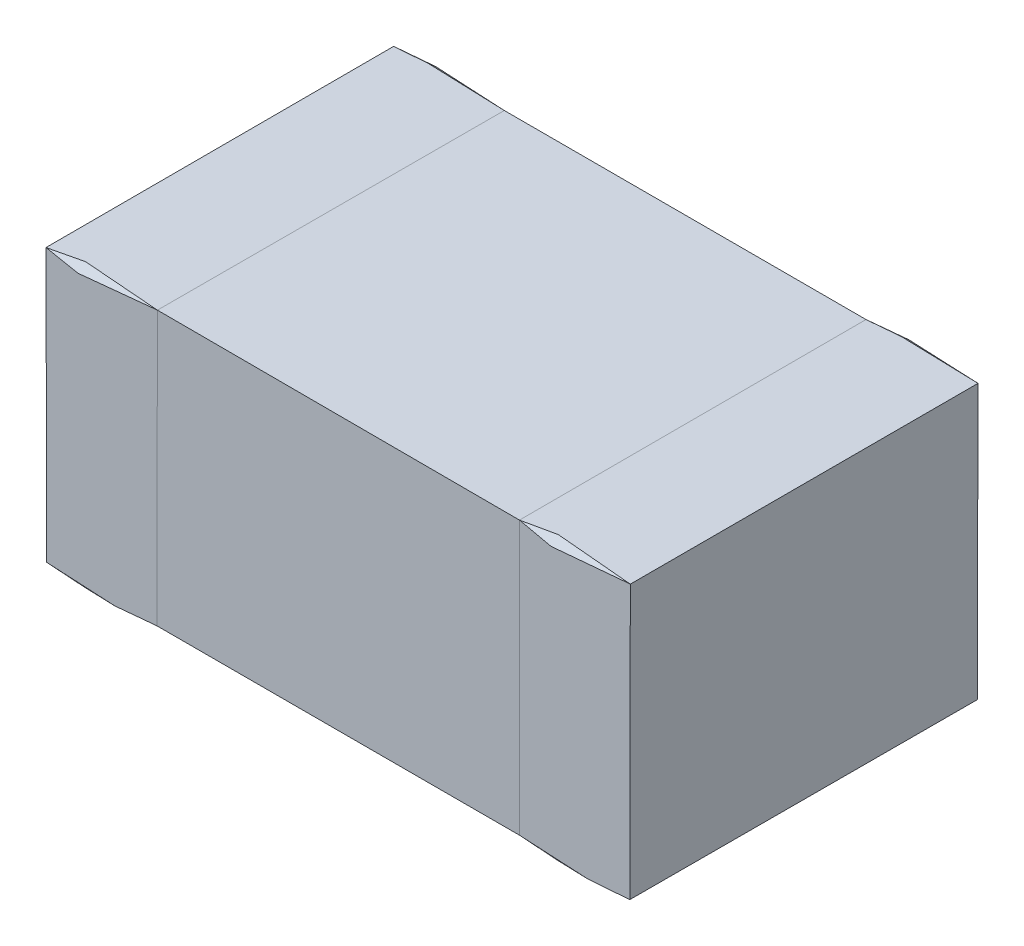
ISO-10303-21;
HEADER;
FILE_DESCRIPTION(('STEP AP214'),'2;1');
FILE_NAME('part.step','',(''),(''),'','','');
FILE_SCHEMA(('AUTOMOTIVE_DESIGN { 1 0 10303 214 1 1 1 1 }'));
ENDSEC;
DATA;
#1=APPLICATION_CONTEXT('core data for automotive mechanical design processes');
#2=APPLICATION_PROTOCOL_DEFINITION('international standard','automotive_design',2000,#1);
#3=PRODUCT_CONTEXT('',#1,'mechanical');
#4=PRODUCT('Part','Part','',(#3));
#5=PRODUCT_RELATED_PRODUCT_CATEGORY('part','',(#4));
#6=PRODUCT_DEFINITION_FORMATION('','',#4);
#7=PRODUCT_DEFINITION_CONTEXT('part definition',#1,'design');
#8=PRODUCT_DEFINITION('design','',#6,#7);
#9=PRODUCT_DEFINITION_SHAPE('','',#8);
#10=(LENGTH_UNIT() NAMED_UNIT(*) SI_UNIT(.MILLI.,.METRE.));
#11=(NAMED_UNIT(*) PLANE_ANGLE_UNIT() SI_UNIT($,.RADIAN.));
#12=(NAMED_UNIT(*) SI_UNIT($,.STERADIAN.) SOLID_ANGLE_UNIT());
#13=UNCERTAINTY_MEASURE_WITH_UNIT(LENGTH_MEASURE(1.E-05),#10,'distance_accuracy_value','');
#14=(GEOMETRIC_REPRESENTATION_CONTEXT(3) GLOBAL_UNCERTAINTY_ASSIGNED_CONTEXT((#13)) GLOBAL_UNIT_ASSIGNED_CONTEXT((#10,
#11,#12)) REPRESENTATION_CONTEXT('',''));
#15=CARTESIAN_POINT('',(0.,0.,0.));
#16=DIRECTION('',(0.,0.,1.));
#17=DIRECTION('',(1.,0.,0.));
#18=AXIS2_PLACEMENT_3D('',#15,#16,#17);
#19=CARTESIAN_POINT('',(0.803249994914,0.363011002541,0.986978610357));
#20=DIRECTION('',(-1.,0.,0.));
#21=DIRECTION('',(0.,0.,1.));
#22=AXIS2_PLACEMENT_3D('',#19,#20,#21);
#23=PLANE('',#22);
#24=CARTESIAN_POINT('',(0.803249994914,-0.363011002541,0.986978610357));
#25=DIRECTION('',(0.,0.,-1.));
#26=VECTOR('',#25,1.);
#27=LINE('',#24,#26);
#28=CARTESIAN_POINT('',(0.789861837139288,-0.370351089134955,0.995986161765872));
#29=VERTEX_POINT('',#28);
#30=CARTESIAN_POINT('',(0.791047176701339,-0.37070329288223,0.0560205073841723));
#31=VERTEX_POINT('',#30);
#32=EDGE_CURVE('E85',#29,#31,#27,.T.);
#33=ORIENTED_EDGE('',*,*,#32,.T.);
#34=CARTESIAN_POINT('',(0.803249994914,-0.363011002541,0.0630712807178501));
#35=DIRECTION('',(0.,1.,0.));
#36=VECTOR('',#35,1.);
#37=LINE('',#34,#36);
#38=CARTESIAN_POINT('',(0.790208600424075,0.36933356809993,0.0533398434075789));
#39=VERTEX_POINT('',#38);
#40=EDGE_CURVE('E120',#31,#39,#37,.T.);
#41=ORIENTED_EDGE('',*,*,#40,.T.);
#42=CARTESIAN_POINT('',(0.803249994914,0.363011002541,0.0630712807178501));
#43=DIRECTION('',(0.,0.,1.));
#44=VECTOR('',#43,1.);
#45=LINE('',#42,#44);
#46=CARTESIAN_POINT('',(0.790788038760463,0.369808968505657,0.995402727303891));
#47=VERTEX_POINT('',#46);
#48=EDGE_CURVE('E118',#39,#47,#45,.T.);
#49=ORIENTED_EDGE('',*,*,#48,.T.);
#50=CARTESIAN_POINT('',(0.803249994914,0.363011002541,0.986978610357));
#51=DIRECTION('',(0.,-1.,0.));
#52=VECTOR('',#51,1.);
#53=LINE('',#50,#52);
#54=EDGE_CURVE('E107',#47,#29,#53,.T.);
#55=ORIENTED_EDGE('',*,*,#54,.T.);
#56=EDGE_LOOP('',(#33,#41,#49,#55));
#57=FACE_BOUND('',#56,.T.);
#58=ADVANCED_FACE('F17',(#57),#23,.F.);
#59=CARTESIAN_POINT('',(-0.803249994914,-0.363011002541,0.986978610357));
#60=DIRECTION('',(1.,0.,0.));
#61=DIRECTION('',(0.,0.,-1.));
#62=AXIS2_PLACEMENT_3D('',#59,#60,#61);
#63=PLANE('',#62);
#64=CARTESIAN_POINT('',(-0.803249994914,0.363011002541,0.986978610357));
#65=DIRECTION('',(0.,0.,-1.));
#66=VECTOR('',#65,1.);
#67=LINE('',#64,#66);
#68=CARTESIAN_POINT('',(-0.790208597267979,0.369333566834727,0.996710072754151));
#69=VERTEX_POINT('',#68);
#70=CARTESIAN_POINT('',(-0.790788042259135,0.369808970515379,0.0546471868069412));
#71=VERTEX_POINT('',#70);
#72=EDGE_CURVE('E371',#69,#71,#67,.T.);
#73=ORIENTED_EDGE('',*,*,#72,.T.);
#74=CARTESIAN_POINT('',(-0.803249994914,0.363011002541,0.0630712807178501));
#75=DIRECTION('',(0.,-1.,0.));
#76=VECTOR('',#75,1.);
#77=LINE('',#74,#76);
#78=CARTESIAN_POINT('',(-0.790208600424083,-0.36933356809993,0.0533398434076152));
#79=VERTEX_POINT('',#78);
#80=EDGE_CURVE('E396',#71,#79,#77,.T.);
#81=ORIENTED_EDGE('',*,*,#80,.T.);
#82=CARTESIAN_POINT('',(-0.803249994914,-0.363011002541,0.0630712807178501));
#83=DIRECTION('',(0.,0.,1.));
#84=VECTOR('',#83,1.);
#85=LINE('',#82,#84);
#86=CARTESIAN_POINT('',(-0.791047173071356,-0.370703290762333,0.994029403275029));
#87=VERTEX_POINT('',#86);
#88=EDGE_CURVE('E435',#79,#87,#85,.T.);
#89=ORIENTED_EDGE('',*,*,#88,.T.);
#90=CARTESIAN_POINT('',(-0.803249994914,-0.363011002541,0.986978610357));
#91=DIRECTION('',(0.,1.,0.));
#92=VECTOR('',#91,1.);
#93=LINE('',#90,#92);
#94=EDGE_CURVE('E331',#87,#69,#93,.T.);
#95=ORIENTED_EDGE('',*,*,#94,.T.);
#96=EDGE_LOOP('',(#73,#81,#89,#95));
#97=FACE_BOUND('',#96,.T.);
#98=ADVANCED_FACE('F394',(#97),#63,.F.);
#99=CARTESIAN_POINT('',(0.784083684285,-0.382500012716,0.06056613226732));
#100=DIRECTION('',(0.,1.,0.));
#101=DIRECTION('',(0.,0.,1.));
#102=AXIS2_PLACEMENT_3D('',#99,#100,#101);
#103=PLANE('',#102);
#104=CARTESIAN_POINT('',(0.497604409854,-0.382500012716,0.989483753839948));
#105=DIRECTION('',(0.,0.,-1.));
#106=VECTOR('',#105,1.);
#107=LINE('',#104,#106);
#108=CARTESIAN_POINT('',(0.490356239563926,-0.369497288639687,0.995052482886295));
#109=VERTEX_POINT('',#108);
#110=CARTESIAN_POINT('',(0.490603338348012,-0.368634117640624,0.0536758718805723));
#111=VERTEX_POINT('',#110);
#112=EDGE_CURVE('E147',#109,#111,#107,.T.);
#113=ORIENTED_EDGE('',*,*,#112,.T.);
#114=DIRECTION('',(1.,0.,0.));
#115=VECTOR('',#114,1.);
#116=CARTESIAN_POINT('',(0.634526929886,-0.382500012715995,0.0605661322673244));
#117=LINE('',#116,#115);
#118=EDGE_CURVE('E82',#31,#111,#117,.F.);
#119=ORIENTED_EDGE('',*,*,#118,.F.);
#120=ORIENTED_EDGE('',*,*,#32,.F.);
#121=DIRECTION('',(1.,0.,0.));
#122=VECTOR('',#121,1.);
#123=CARTESIAN_POINT('',(0.634526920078,-0.382500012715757,0.98948375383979));
#124=LINE('',#123,#122);
#125=EDGE_CURVE('E89',#109,#29,#124,.T.);
#126=ORIENTED_EDGE('',*,*,#125,.F.);
#127=EDGE_LOOP('',(#113,#119,#120,#126));
#128=FACE_BOUND('',#127,.T.);
#129=ADVANCED_FACE('F88',(#128),#103,.F.);
#130=CARTESIAN_POINT('',(0.647161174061,-0.369707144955,1.004283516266));
#131=DIRECTION('',(0.,-0.756538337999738,0.653949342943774));
#132=DIRECTION('',(0.,-0.653949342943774,-0.756538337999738));
#133=AXIS2_PLACEMENT_3D('',#130,#131,#132);
#134=PLANE('',#133);
#135=DIRECTION('',(-1.,0.,0.));
#136=VECTOR('',#135,1.);
#137=CARTESIAN_POINT('',(0.497604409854,-0.365176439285,1.009524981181));
#138=LINE('',#137,#136);
#139=EDGE_CURVE('E101',#29,#109,#138,.T.);
#140=ORIENTED_EDGE('',*,*,#139,.T.);
#141=ORIENTED_EDGE('',*,*,#125,.T.);
#142=EDGE_LOOP('',(#140,#141));
#143=FACE_BOUND('',#142,.T.);
#144=ADVANCED_FACE('F100',(#143),#134,.T.);
#145=CARTESIAN_POINT('',(0.647161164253,-0.36970714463,0.04576641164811));
#146=DIRECTION('',(0.,-0.756537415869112,-0.653950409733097));
#147=DIRECTION('',(0.,0.653950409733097,-0.756537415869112));
#148=AXIS2_PLACEMENT_3D('',#145,#146,#147);
#149=PLANE('',#148);
#150=DIRECTION('',(1.,0.,0.));
#151=VECTOR('',#150,1.);
#152=CARTESIAN_POINT('',(0.497604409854,-0.365176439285,0.04052496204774));
#153=LINE('',#152,#151);
#154=EDGE_CURVE('E113',#111,#31,#153,.T.);
#155=ORIENTED_EDGE('',*,*,#154,.T.);
#156=ORIENTED_EDGE('',*,*,#118,.T.);
#157=EDGE_LOOP('',(#155,#156));
#158=FACE_BOUND('',#157,.T.);
#159=ADVANCED_FACE('F490',(#158),#149,.T.);
#160=CARTESIAN_POINT('',(0.497604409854,0.365176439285,1.009524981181));
#161=DIRECTION('',(0.,0.,-1.));
#162=DIRECTION('',(-1.,0.,0.));
#163=AXIS2_PLACEMENT_3D('',#160,#161,#162);
#164=PLANE('',#163);
#165=ORIENTED_EDGE('',*,*,#54,.F.);
#166=DIRECTION('',(1.,0.,0.));
#167=VECTOR('',#166,1.);
#168=CARTESIAN_POINT('',(0.634526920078,0.365176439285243,1.00952498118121));
#169=LINE('',#168,#167);
#170=CARTESIAN_POINT('',(0.490006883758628,0.369300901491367,0.994823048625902));
#171=VERTEX_POINT('',#170);
#172=EDGE_CURVE('E119',#47,#171,#169,.F.);
#173=ORIENTED_EDGE('',*,*,#172,.T.);
#174=CARTESIAN_POINT('',(0.497604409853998,0.365176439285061,1.009524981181));
#175=DIRECTION('',(0.,-1.,0.));
#176=VECTOR('',#175,1.);
#177=LINE('',#174,#176);
#178=EDGE_CURVE('E111',#171,#109,#177,.T.);
#179=ORIENTED_EDGE('',*,*,#178,.T.);
#180=ORIENTED_EDGE('',*,*,#139,.F.);
#181=EDGE_LOOP('',(#165,#173,#179,#180));
#182=FACE_BOUND('',#181,.T.);
#183=ADVANCED_FACE('F105',(#182),#164,.F.);
#184=CARTESIAN_POINT('',(0.497604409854,-0.365176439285,0.04052496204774));
#185=DIRECTION('',(0.,0.,1.));
#186=DIRECTION('',(1.,0.,0.));
#187=AXIS2_PLACEMENT_3D('',#184,#185,#186);
#188=PLANE('',#187);
#189=DIRECTION('',(1.,0.,0.));
#190=VECTOR('',#189,1.);
#191=CARTESIAN_POINT('',(0.634526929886,0.36517643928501,0.0405249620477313));
#192=LINE('',#191,#190);
#193=CARTESIAN_POINT('',(0.490135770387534,0.370537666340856,0.056489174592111));
#194=VERTEX_POINT('',#193);
#195=EDGE_CURVE('E262',#39,#194,#192,.F.);
#196=ORIENTED_EDGE('',*,*,#195,.F.);
#197=ORIENTED_EDGE('',*,*,#40,.F.);
#198=ORIENTED_EDGE('',*,*,#154,.F.);
#199=CARTESIAN_POINT('',(0.497604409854,-0.365176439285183,0.04052496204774));
#200=DIRECTION('',(0.,1.,0.));
#201=VECTOR('',#200,1.);
#202=LINE('',#199,#201);
#203=EDGE_CURVE('E377',#111,#194,#202,.T.);
#204=ORIENTED_EDGE('',*,*,#203,.T.);
#205=EDGE_LOOP('',(#196,#197,#198,#204));
#206=FACE_BOUND('',#205,.T.);
#207=ADVANCED_FACE('F242',(#206),#188,.F.);
#208=CARTESIAN_POINT('',(0.647161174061,0.377969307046,0.994725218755));
#209=DIRECTION('',(0.,-0.756538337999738,-0.653949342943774));
#210=DIRECTION('',(0.,0.653949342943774,-0.756538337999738));
#211=AXIS2_PLACEMENT_3D('',#208,#209,#210);
#212=PLANE('',#211);
#213=DIRECTION('',(1.,0.,0.));
#214=VECTOR('',#213,1.);
#215=CARTESIAN_POINT('',(0.497604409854,0.382500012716,0.98948375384));
#216=LINE('',#215,#214);
#217=EDGE_CURVE('E270',#47,#171,#216,.F.);
#218=ORIENTED_EDGE('',*,*,#217,.T.);
#219=ORIENTED_EDGE('',*,*,#172,.F.);
#220=EDGE_LOOP('',(#218,#219));
#221=FACE_BOUND('',#220,.T.);
#222=ADVANCED_FACE('F251',(#221),#212,.F.);
#223=CARTESIAN_POINT('',(0.647161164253,0.377969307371,0.05532468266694));
#224=DIRECTION('',(0.,-0.756537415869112,0.653950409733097));
#225=DIRECTION('',(0.,-0.653950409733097,-0.756537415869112));
#226=AXIS2_PLACEMENT_3D('',#223,#224,#225);
#227=PLANE('',#226);
#228=DIRECTION('',(1.,0.,0.));
#229=VECTOR('',#228,1.);
#230=CARTESIAN_POINT('',(0.497604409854,0.382500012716,0.06056613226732));
#231=LINE('',#230,#229);
#232=EDGE_CURVE('E273',#194,#39,#231,.T.);
#233=ORIENTED_EDGE('',*,*,#232,.T.);
#234=ORIENTED_EDGE('',*,*,#195,.T.);
#235=EDGE_LOOP('',(#233,#234));
#236=FACE_BOUND('',#235,.T.);
#237=ADVANCED_FACE('F454',(#236),#227,.F.);
#238=CARTESIAN_POINT('',(0.497604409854,0.382500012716,0.06056613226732));
#239=DIRECTION('',(0.,-1.,0.));
#240=DIRECTION('',(0.,0.,-1.));
#241=AXIS2_PLACEMENT_3D('',#238,#239,#240);
#242=PLANE('',#241);
#243=ORIENTED_EDGE('',*,*,#48,.F.);
#244=ORIENTED_EDGE('',*,*,#232,.F.);
#245=CARTESIAN_POINT('',(0.497604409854,0.382500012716,0.0605661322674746));
#246=DIRECTION('',(0.,0.,1.));
#247=VECTOR('',#246,1.);
#248=LINE('',#245,#247);
#249=EDGE_CURVE('E225',#194,#171,#248,.T.);
#250=ORIENTED_EDGE('',*,*,#249,.T.);
#251=ORIENTED_EDGE('',*,*,#217,.F.);
#252=EDGE_LOOP('',(#243,#244,#250,#251));
#253=FACE_BOUND('',#252,.T.);
#254=ADVANCED_FACE('F204',(#253),#242,.F.);
#255=CARTESIAN_POINT('',(-0.784083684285,-0.382500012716,0.98948375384));
#256=DIRECTION('',(0.,1.,0.));
#257=DIRECTION('',(0.,0.,1.));
#258=AXIS2_PLACEMENT_3D('',#255,#256,#257);
#259=PLANE('',#258);
#260=CARTESIAN_POINT('',(-0.498102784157,-0.382500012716,0.0605661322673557));
#261=DIRECTION('',(0.,0.,1.));
#262=VECTOR('',#261,1.);
#263=LINE('',#260,#262);
#264=CARTESIAN_POINT('',(-0.490313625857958,-0.370438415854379,0.0567932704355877));
#265=VERTEX_POINT('',#264);
#266=CARTESIAN_POINT('',(-0.490597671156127,-0.368229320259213,0.996183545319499));
#267=VERTEX_POINT('',#266);
#268=EDGE_CURVE('E28',#265,#267,#263,.T.);
#269=ORIENTED_EDGE('',*,*,#268,.T.);
#270=DIRECTION('',(1.,0.,0.));
#271=VECTOR('',#270,1.);
#272=CARTESIAN_POINT('',(-0.634776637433,-0.382500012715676,0.98948375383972));
#273=LINE('',#272,#271);
#274=EDGE_CURVE('E191',#267,#87,#273,.F.);
#275=ORIENTED_EDGE('',*,*,#274,.T.);
#276=ORIENTED_EDGE('',*,*,#88,.F.);
#277=DIRECTION('',(1.,0.,0.));
#278=VECTOR('',#277,1.);
#279=CARTESIAN_POINT('',(-0.647409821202,-0.382500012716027,0.0605661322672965));
#280=LINE('',#279,#278);
#281=EDGE_CURVE('E492',#265,#79,#280,.F.);
#282=ORIENTED_EDGE('',*,*,#281,.F.);
#283=EDGE_LOOP('',(#269,#275,#276,#282));
#284=FACE_BOUND('',#283,.T.);
#285=ADVANCED_FACE('F193',(#284),#259,.F.);
#286=CARTESIAN_POINT('',(-0.784083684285,-0.365176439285,0.04052496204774));
#287=DIRECTION('',(0.,0.756537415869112,0.653950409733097));
#288=DIRECTION('',(0.,-0.653950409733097,0.756537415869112));
#289=AXIS2_PLACEMENT_3D('',#286,#287,#288);
#290=PLANE('',#289);
#291=DIRECTION('',(1.,0.,0.));
#292=VECTOR('',#291,1.);
#293=CARTESIAN_POINT('',(-0.784083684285,-0.365176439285,0.04052496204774));
#294=LINE('',#293,#292);
#295=EDGE_CURVE('E497',#79,#265,#294,.T.);
#296=ORIENTED_EDGE('',*,*,#295,.T.);
#297=ORIENTED_EDGE('',*,*,#281,.T.);
#298=EDGE_LOOP('',(#296,#297));
#299=FACE_BOUND('',#298,.T.);
#300=ADVANCED_FACE('F203',(#299),#290,.F.);
#301=CARTESIAN_POINT('',(-0.647409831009,-0.369707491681,1.004283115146));
#302=DIRECTION('',(0.,0.756538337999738,-0.653949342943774));
#303=DIRECTION('',(0.,0.653949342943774,0.756538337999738));
#304=AXIS2_PLACEMENT_3D('',#301,#302,#303);
#305=PLANE('',#304);
#306=DIRECTION('',(-1.,0.,0.));
#307=VECTOR('',#306,1.);
#308=CARTESIAN_POINT('',(-0.784083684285,-0.365176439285,1.009524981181));
#309=LINE('',#308,#307);
#310=EDGE_CURVE('E712',#267,#87,#309,.T.);
#311=ORIENTED_EDGE('',*,*,#310,.T.);
#312=ORIENTED_EDGE('',*,*,#274,.F.);
#313=EDGE_LOOP('',(#311,#312));
#314=FACE_BOUND('',#313,.T.);
#315=ADVANCED_FACE('F536',(#314),#305,.F.);
#316=CARTESIAN_POINT('',(-0.784083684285,-0.365176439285,0.04052496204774));
#317=DIRECTION('',(0.,0.,1.));
#318=DIRECTION('',(1.,0.,0.));
#319=AXIS2_PLACEMENT_3D('',#316,#317,#318);
#320=PLANE('',#319);
#321=DIRECTION('',(1.,0.,0.));
#322=VECTOR('',#321,1.);
#323=CARTESIAN_POINT('',(-0.63477664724,0.365176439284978,0.0405249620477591));
#324=LINE('',#323,#322);
#325=CARTESIAN_POINT('',(-0.490854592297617,0.369497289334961,0.0549974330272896));
#326=VERTEX_POINT('',#325);
#327=EDGE_CURVE('E365',#71,#326,#324,.T.);
#328=ORIENTED_EDGE('',*,*,#327,.T.);
#329=CARTESIAN_POINT('',(-0.498102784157,0.365176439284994,0.04052496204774));
#330=DIRECTION('',(0.,-1.,0.));
#331=VECTOR('',#330,1.);
#332=LINE('',#329,#331);
#333=EDGE_CURVE('E387',#326,#265,#332,.T.);
#334=ORIENTED_EDGE('',*,*,#333,.T.);
#335=ORIENTED_EDGE('',*,*,#295,.F.);
#336=ORIENTED_EDGE('',*,*,#80,.F.);
#337=EDGE_LOOP('',(#328,#334,#335,#336));
#338=FACE_BOUND('',#337,.T.);
#339=ADVANCED_FACE('F349',(#338),#320,.F.);
#340=CARTESIAN_POINT('',(-0.784083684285,0.365176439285,1.009524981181));
#341=DIRECTION('',(0.,0.,-1.));
#342=DIRECTION('',(-1.,0.,0.));
#343=AXIS2_PLACEMENT_3D('',#340,#341,#342);
#344=PLANE('',#343);
#345=CARTESIAN_POINT('',(-0.498102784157,-0.365176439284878,1.009524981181));
#346=DIRECTION('',(0.,1.,0.));
#347=VECTOR('',#346,1.);
#348=LINE('',#345,#347);
#349=CARTESIAN_POINT('',(-0.491139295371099,0.370703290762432,0.994029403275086));
#350=VERTEX_POINT('',#349);
#351=EDGE_CURVE('E36',#267,#350,#348,.T.);
#352=ORIENTED_EDGE('',*,*,#351,.T.);
#353=DIRECTION('',(1.,0.,0.));
#354=VECTOR('',#353,1.);
#355=CARTESIAN_POINT('',(-0.634776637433,0.365176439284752,1.00952498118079));
#356=LINE('',#355,#354);
#357=EDGE_CURVE('E358',#350,#69,#356,.F.);
#358=ORIENTED_EDGE('',*,*,#357,.T.);
#359=ORIENTED_EDGE('',*,*,#94,.F.);
#360=ORIENTED_EDGE('',*,*,#310,.F.);
#361=EDGE_LOOP('',(#352,#358,#359,#360));
#362=FACE_BOUND('',#361,.T.);
#363=ADVANCED_FACE('F338',(#362),#344,.F.);
#364=CARTESIAN_POINT('',(-0.784083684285,0.365176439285,0.04052496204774));
#365=DIRECTION('',(0.,-0.756537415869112,0.653950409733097));
#366=DIRECTION('',(0.,-0.653950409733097,-0.756537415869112));
#367=AXIS2_PLACEMENT_3D('',#364,#365,#366);
#368=PLANE('',#367);
#369=DIRECTION('',(1.,0.,0.));
#370=VECTOR('',#369,1.);
#371=CARTESIAN_POINT('',(-0.498102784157,0.382500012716,0.06056613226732));
#372=LINE('',#371,#370);
#373=EDGE_CURVE('E288',#71,#326,#372,.T.);
#374=ORIENTED_EDGE('',*,*,#373,.T.);
#375=ORIENTED_EDGE('',*,*,#327,.F.);
#376=EDGE_LOOP('',(#374,#375));
#377=FACE_BOUND('',#376,.T.);
#378=ADVANCED_FACE('F348',(#377),#368,.F.);
#379=CARTESIAN_POINT('',(-0.498102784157,0.382500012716,0.98948375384));
#380=DIRECTION('',(0.,-0.756538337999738,-0.653949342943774));
#381=DIRECTION('',(0.,0.653949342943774,-0.756538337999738));
#382=AXIS2_PLACEMENT_3D('',#379,#380,#381);
#383=PLANE('',#382);
#384=DIRECTION('',(1.,0.,0.));
#385=VECTOR('',#384,1.);
#386=CARTESIAN_POINT('',(-0.498102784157,0.382500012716,0.98948375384));
#387=LINE('',#386,#385);
#388=EDGE_CURVE('E368',#350,#69,#387,.F.);
#389=ORIENTED_EDGE('',*,*,#388,.T.);
#390=ORIENTED_EDGE('',*,*,#357,.F.);
#391=EDGE_LOOP('',(#389,#390));
#392=FACE_BOUND('',#391,.T.);
#393=ADVANCED_FACE('F503',(#392),#383,.F.);
#394=CARTESIAN_POINT('',(-0.498102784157,0.382500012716,0.98948375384));
#395=DIRECTION('',(0.,-1.,0.));
#396=DIRECTION('',(0.,0.,-1.));
#397=AXIS2_PLACEMENT_3D('',#394,#395,#396);
#398=PLANE('',#397);
#399=ORIENTED_EDGE('',*,*,#72,.F.);
#400=ORIENTED_EDGE('',*,*,#388,.F.);
#401=CARTESIAN_POINT('',(-0.498102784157,0.382500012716,0.989483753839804));
#402=DIRECTION('',(0.,0.,-1.));
#403=VECTOR('',#402,1.);
#404=LINE('',#401,#403);
#405=EDGE_CURVE('E282',#350,#326,#404,.T.);
#406=ORIENTED_EDGE('',*,*,#405,.T.);
#407=ORIENTED_EDGE('',*,*,#373,.F.);
#408=EDGE_LOOP('',(#399,#400,#406,#407));
#409=FACE_BOUND('',#408,.T.);
#410=ADVANCED_FACE('F300',(#409),#398,.F.);
#411=CARTESIAN_POINT('',(0.478438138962,0.363011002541,0.986978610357));
#412=DIRECTION('',(0.,-1.,0.));
#413=DIRECTION('',(0.,0.,-1.));
#414=AXIS2_PLACEMENT_3D('',#411,#412,#413);
#415=PLANE('',#414);
#416=ORIENTED_EDGE('',*,*,#405,.F.);
#417=DIRECTION('',(-1.,0.,0.));
#418=VECTOR('',#417,1.);
#419=CARTESIAN_POINT('',(0.478438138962,0.363011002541,0.986978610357));
#420=LINE('',#419,#418);
#421=EDGE_CURVE('E457',#350,#171,#420,.F.);
#422=ORIENTED_EDGE('',*,*,#421,.T.);
#423=ORIENTED_EDGE('',*,*,#249,.F.);
#424=DIRECTION('',(1.,0.,0.));
#425=VECTOR('',#424,1.);
#426=CARTESIAN_POINT('',(0.478438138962,0.363011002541,0.06307128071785));
#427=LINE('',#426,#425);
#428=EDGE_CURVE('E381',#194,#326,#427,.F.);
#429=ORIENTED_EDGE('',*,*,#428,.T.);
#430=EDGE_LOOP('',(#416,#422,#423,#429));
#431=FACE_BOUND('',#430,.T.);
#432=ADVANCED_FACE('F290',(#431),#415,.F.);
#433=CARTESIAN_POINT('',(0.478438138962,0.363011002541,0.06307128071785));
#434=DIRECTION('',(0.,0.,1.));
#435=DIRECTION('',(1.,0.,0.));
#436=AXIS2_PLACEMENT_3D('',#433,#434,#435);
#437=PLANE('',#436);
#438=DIRECTION('',(1.,0.,0.));
#439=VECTOR('',#438,1.);
#440=CARTESIAN_POINT('',(0.478438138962,-0.363011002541,0.0630712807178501));
#441=LINE('',#440,#439);
#442=EDGE_CURVE('E171',#111,#265,#441,.F.);
#443=ORIENTED_EDGE('',*,*,#442,.T.);
#444=ORIENTED_EDGE('',*,*,#333,.F.);
#445=ORIENTED_EDGE('',*,*,#428,.F.);
#446=ORIENTED_EDGE('',*,*,#203,.F.);
#447=EDGE_LOOP('',(#443,#444,#445,#446));
#448=FACE_BOUND('',#447,.T.);
#449=ADVANCED_FACE('F299',(#448),#437,.F.);
#450=CARTESIAN_POINT('',(0.478438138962,0.363011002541,0.986978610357));
#451=DIRECTION('',(0.,0.,-1.));
#452=DIRECTION('',(-1.,0.,0.));
#453=AXIS2_PLACEMENT_3D('',#450,#451,#452);
#454=PLANE('',#453);
#455=DIRECTION('',(1.,0.,0.));
#456=VECTOR('',#455,1.);
#457=CARTESIAN_POINT('',(0.478438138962,-0.363011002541,0.986978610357));
#458=LINE('',#457,#456);
#459=EDGE_CURVE('E11',#267,#109,#458,.T.);
#460=ORIENTED_EDGE('',*,*,#459,.T.);
#461=ORIENTED_EDGE('',*,*,#178,.F.);
#462=ORIENTED_EDGE('',*,*,#421,.F.);
#463=ORIENTED_EDGE('',*,*,#351,.F.);
#464=EDGE_LOOP('',(#460,#461,#462,#463));
#465=FACE_BOUND('',#464,.T.);
#466=ADVANCED_FACE('F161',(#465),#454,.F.);
#467=CARTESIAN_POINT('',(0.478438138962,-0.363011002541,0.986978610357));
#468=DIRECTION('',(0.,1.,0.));
#469=DIRECTION('',(0.,0.,1.));
#470=AXIS2_PLACEMENT_3D('',#467,#468,#469);
#471=PLANE('',#470);
#472=ORIENTED_EDGE('',*,*,#268,.F.);
#473=ORIENTED_EDGE('',*,*,#442,.F.);
#474=ORIENTED_EDGE('',*,*,#112,.F.);
#475=ORIENTED_EDGE('',*,*,#459,.F.);
#476=EDGE_LOOP('',(#472,#473,#474,#475));
#477=FACE_BOUND('',#476,.T.);
#478=ADVANCED_FACE('F152',(#477),#471,.F.);
#479=CLOSED_SHELL('',(#58,#98,#129,#144,#159,#183,#207,#222,#237,#254,#285,#300,#315,#339,#363,
#378,#393,#410,#432,#449,#466,#478));
#480=MANIFOLD_SOLID_BREP('B1',#479);
#481=ADVANCED_BREP_SHAPE_REPRESENTATION('',(#18,#480),#14);
#482=SHAPE_DEFINITION_REPRESENTATION(#9,#481);
ENDSEC;
END-ISO-10303-21;
